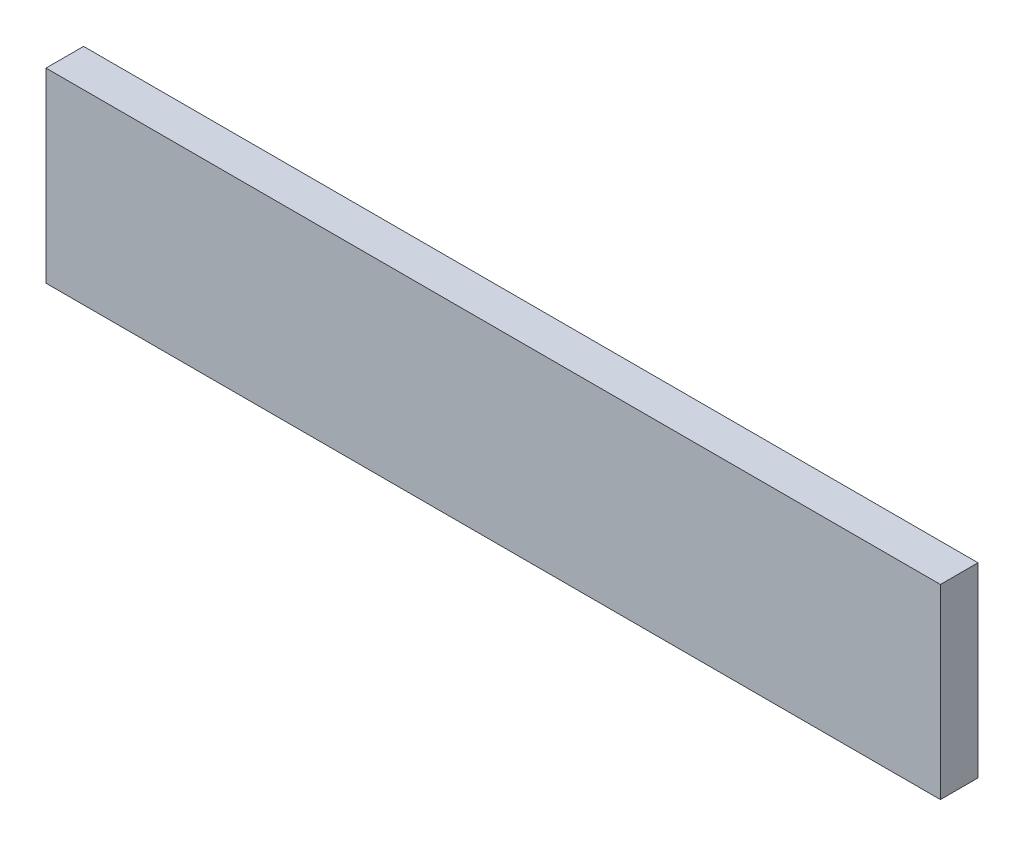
ISO-10303-21;
HEADER;
FILE_DESCRIPTION(('STEP AP214'),'2;1');
FILE_NAME('part.step','',(''),(''),'','','');
FILE_SCHEMA(('AUTOMOTIVE_DESIGN { 1 0 10303 214 1 1 1 1 }'));
ENDSEC;
DATA;
#1=APPLICATION_CONTEXT('core data for automotive mechanical design processes');
#2=APPLICATION_PROTOCOL_DEFINITION('international standard','automotive_design',2000,#1);
#3=PRODUCT_CONTEXT('',#1,'mechanical');
#4=PRODUCT('Part','Part','',(#3));
#5=PRODUCT_RELATED_PRODUCT_CATEGORY('part','',(#4));
#6=PRODUCT_DEFINITION_FORMATION('','',#4);
#7=PRODUCT_DEFINITION_CONTEXT('part definition',#1,'design');
#8=PRODUCT_DEFINITION('design','',#6,#7);
#9=PRODUCT_DEFINITION_SHAPE('','',#8);
#10=(LENGTH_UNIT() NAMED_UNIT(*) SI_UNIT(.MILLI.,.METRE.));
#11=(NAMED_UNIT(*) PLANE_ANGLE_UNIT() SI_UNIT($,.RADIAN.));
#12=(NAMED_UNIT(*) SI_UNIT($,.STERADIAN.) SOLID_ANGLE_UNIT());
#13=UNCERTAINTY_MEASURE_WITH_UNIT(LENGTH_MEASURE(1.E-05),#10,'distance_accuracy_value','');
#14=(GEOMETRIC_REPRESENTATION_CONTEXT(3) GLOBAL_UNCERTAINTY_ASSIGNED_CONTEXT((#13)) GLOBAL_UNIT_ASSIGNED_CONTEXT((#10,
#11,#12)) REPRESENTATION_CONTEXT('',''));
#15=CARTESIAN_POINT('',(0.,0.,0.));
#16=DIRECTION('',(0.,0.,1.));
#17=DIRECTION('',(1.,0.,0.));
#18=AXIS2_PLACEMENT_3D('',#15,#16,#17);
#19=CARTESIAN_POINT('',(76.2,15.875,0.));
#20=DIRECTION('',(1.,0.,0.));
#21=DIRECTION('',(0.,1.,0.));
#22=AXIS2_PLACEMENT_3D('',#19,#20,#21);
#23=PLANE('',#22);
#24=DIRECTION('',(0.,0.,1.));
#25=VECTOR('',#24,1.);
#26=CARTESIAN_POINT('',(76.2,15.875,0.));
#27=LINE('',#26,#25);
#28=CARTESIAN_POINT('',(76.2,15.875,0.));
#29=VERTEX_POINT('',#28);
#30=CARTESIAN_POINT('',(76.2,15.875,6.40273));
#31=VERTEX_POINT('',#30);
#32=EDGE_CURVE('E17',#29,#31,#27,.T.);
#33=ORIENTED_EDGE('',*,*,#32,.T.);
#34=DIRECTION('',(0.,1.,0.));
#35=VECTOR('',#34,1.);
#36=CARTESIAN_POINT('',(76.2,-15.875,6.40273));
#37=LINE('',#36,#35);
#38=CARTESIAN_POINT('',(76.2,-15.875,6.40273));
#39=VERTEX_POINT('',#38);
#40=EDGE_CURVE('E30',#39,#31,#37,.T.);
#41=ORIENTED_EDGE('',*,*,#40,.F.);
#42=DIRECTION('',(0.,0.,1.));
#43=VECTOR('',#42,1.);
#44=CARTESIAN_POINT('',(76.2,-15.875,0.));
#45=LINE('',#44,#43);
#46=CARTESIAN_POINT('',(76.2,-15.875,0.));
#47=VERTEX_POINT('',#46);
#48=EDGE_CURVE('E9',#47,#39,#45,.T.);
#49=ORIENTED_EDGE('',*,*,#48,.F.);
#50=DIRECTION('',(0.,1.,0.));
#51=VECTOR('',#50,1.);
#52=CARTESIAN_POINT('',(76.2,15.875,0.));
#53=LINE('',#52,#51);
#54=EDGE_CURVE('E80',#47,#29,#53,.T.);
#55=ORIENTED_EDGE('',*,*,#54,.T.);
#56=EDGE_LOOP('',(#33,#41,#49,#55));
#57=FACE_BOUND('',#56,.T.);
#58=ADVANCED_FACE('F14',(#57),#23,.T.);
#59=CARTESIAN_POINT('',(-76.2,-15.875,0.));
#60=DIRECTION('',(0.,-1.,0.));
#61=DIRECTION('',(1.,0.,0.));
#62=AXIS2_PLACEMENT_3D('',#59,#60,#61);
#63=PLANE('',#62);
#64=ORIENTED_EDGE('',*,*,#48,.T.);
#65=DIRECTION('',(1.,0.,0.));
#66=VECTOR('',#65,1.);
#67=CARTESIAN_POINT('',(-76.2,-15.875,6.40273));
#68=LINE('',#67,#66);
#69=CARTESIAN_POINT('',(-76.2,-15.875,6.40273));
#70=VERTEX_POINT('',#69);
#71=EDGE_CURVE('E56',#70,#39,#68,.T.);
#72=ORIENTED_EDGE('',*,*,#71,.F.);
#73=DIRECTION('',(0.,0.,1.));
#74=VECTOR('',#73,1.);
#75=CARTESIAN_POINT('',(-76.2,-15.875,0.));
#76=LINE('',#75,#74);
#77=CARTESIAN_POINT('',(-76.2,-15.875,0.));
#78=VERTEX_POINT('',#77);
#79=EDGE_CURVE('E22',#78,#70,#76,.T.);
#80=ORIENTED_EDGE('',*,*,#79,.F.);
#81=DIRECTION('',(1.,0.,0.));
#82=VECTOR('',#81,1.);
#83=CARTESIAN_POINT('',(-76.2,-15.875,0.));
#84=LINE('',#83,#82);
#85=EDGE_CURVE('E74',#78,#47,#84,.T.);
#86=ORIENTED_EDGE('',*,*,#85,.T.);
#87=EDGE_LOOP('',(#64,#72,#80,#86));
#88=FACE_BOUND('',#87,.T.);
#89=ADVANCED_FACE('F63',(#88),#63,.T.);
#90=CARTESIAN_POINT('',(-76.2,15.875,0.));
#91=DIRECTION('',(-1.,0.,0.));
#92=DIRECTION('',(0.,-1.,0.));
#93=AXIS2_PLACEMENT_3D('',#90,#91,#92);
#94=PLANE('',#93);
#95=ORIENTED_EDGE('',*,*,#79,.T.);
#96=DIRECTION('',(0.,-1.,0.));
#97=VECTOR('',#96,1.);
#98=CARTESIAN_POINT('',(-76.2,15.875,6.40273));
#99=LINE('',#98,#97);
#100=CARTESIAN_POINT('',(-76.2,15.875,6.40273));
#101=VERTEX_POINT('',#100);
#102=EDGE_CURVE('E53',#101,#70,#99,.T.);
#103=ORIENTED_EDGE('',*,*,#102,.F.);
#104=DIRECTION('',(0.,0.,1.));
#105=VECTOR('',#104,1.);
#106=CARTESIAN_POINT('',(-76.2,15.875,0.));
#107=LINE('',#106,#105);
#108=CARTESIAN_POINT('',(-76.2,15.875,0.));
#109=VERTEX_POINT('',#108);
#110=EDGE_CURVE('E71',#109,#101,#107,.T.);
#111=ORIENTED_EDGE('',*,*,#110,.F.);
#112=DIRECTION('',(0.,-1.,0.));
#113=VECTOR('',#112,1.);
#114=CARTESIAN_POINT('',(-76.2,15.875,0.));
#115=LINE('',#114,#113);
#116=EDGE_CURVE('E69',#109,#78,#115,.T.);
#117=ORIENTED_EDGE('',*,*,#116,.T.);
#118=EDGE_LOOP('',(#95,#103,#111,#117));
#119=FACE_BOUND('',#118,.T.);
#120=ADVANCED_FACE('F67',(#119),#94,.T.);
#121=CARTESIAN_POINT('',(-76.2,15.875,0.));
#122=DIRECTION('',(0.,1.,0.));
#123=DIRECTION('',(-1.,0.,0.));
#124=AXIS2_PLACEMENT_3D('',#121,#122,#123);
#125=PLANE('',#124);
#126=ORIENTED_EDGE('',*,*,#110,.T.);
#127=DIRECTION('',(-1.,0.,0.));
#128=VECTOR('',#127,1.);
#129=CARTESIAN_POINT('',(76.2,15.875,6.40273));
#130=LINE('',#129,#128);
#131=EDGE_CURVE('E57',#31,#101,#130,.T.);
#132=ORIENTED_EDGE('',*,*,#131,.F.);
#133=ORIENTED_EDGE('',*,*,#32,.F.);
#134=DIRECTION('',(-1.,0.,0.));
#135=VECTOR('',#134,1.);
#136=CARTESIAN_POINT('',(-76.2,15.875,0.));
#137=LINE('',#136,#135);
#138=EDGE_CURVE('E77',#29,#109,#137,.T.);
#139=ORIENTED_EDGE('',*,*,#138,.T.);
#140=EDGE_LOOP('',(#126,#132,#133,#139));
#141=FACE_BOUND('',#140,.T.);
#142=ADVANCED_FACE('F88',(#141),#125,.T.);
#143=CARTESIAN_POINT('',(0.,0.,0.));
#144=DIRECTION('',(0.,0.,1.));
#145=DIRECTION('',(0.,-1.,0.));
#146=AXIS2_PLACEMENT_3D('',#143,#144,#145);
#147=PLANE('',#146);
#148=ORIENTED_EDGE('',*,*,#54,.F.);
#149=ORIENTED_EDGE('',*,*,#85,.F.);
#150=ORIENTED_EDGE('',*,*,#116,.F.);
#151=ORIENTED_EDGE('',*,*,#138,.F.);
#152=EDGE_LOOP('',(#148,#149,#150,#151));
#153=FACE_BOUND('',#152,.T.);
#154=ADVANCED_FACE('F86',(#153),#147,.F.);
#155=CARTESIAN_POINT('',(0.,0.,6.40273));
#156=DIRECTION('',(0.,0.,1.));
#157=DIRECTION('',(1.,0.,0.));
#158=AXIS2_PLACEMENT_3D('',#155,#156,#157);
#159=PLANE('',#158);
#160=ORIENTED_EDGE('',*,*,#102,.T.);
#161=ORIENTED_EDGE('',*,*,#71,.T.);
#162=ORIENTED_EDGE('',*,*,#40,.T.);
#163=ORIENTED_EDGE('',*,*,#131,.T.);
#164=EDGE_LOOP('',(#160,#161,#162,#163));
#165=FACE_BOUND('',#164,.T.);
#166=ADVANCED_FACE('F55',(#165),#159,.T.);
#167=CLOSED_SHELL('',(#58,#89,#120,#142,#154,#166));
#168=MANIFOLD_SOLID_BREP('B1',#167);
#169=ADVANCED_BREP_SHAPE_REPRESENTATION('',(#18,#168),#14);
#170=SHAPE_DEFINITION_REPRESENTATION(#9,#169);
ENDSEC;
END-ISO-10303-21;
